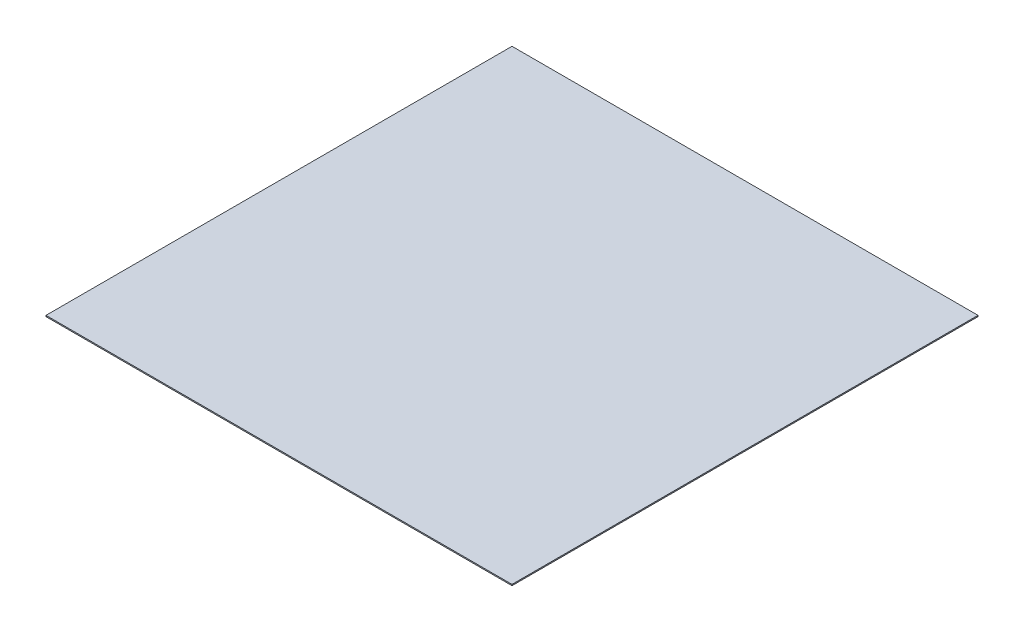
from build123d import *

# Parameters (mm, degrees)
ESQUISSE1_W        = 2000
ESQUISSE1_H        = 5
EXTRU_MINCE1_DEPTH = 1000


with BuildPart() as part:
    # Esquisse1 → Extru.-Mince1 (new, symmetric)
    with BuildSketch(Plane.XY):
        with Locations((0, -2.5)):
            Rectangle(ESQUISSE1_W, ESQUISSE1_H)
    extrude(amount=EXTRU_MINCE1_DEPTH, both=True)


solid = part.part
